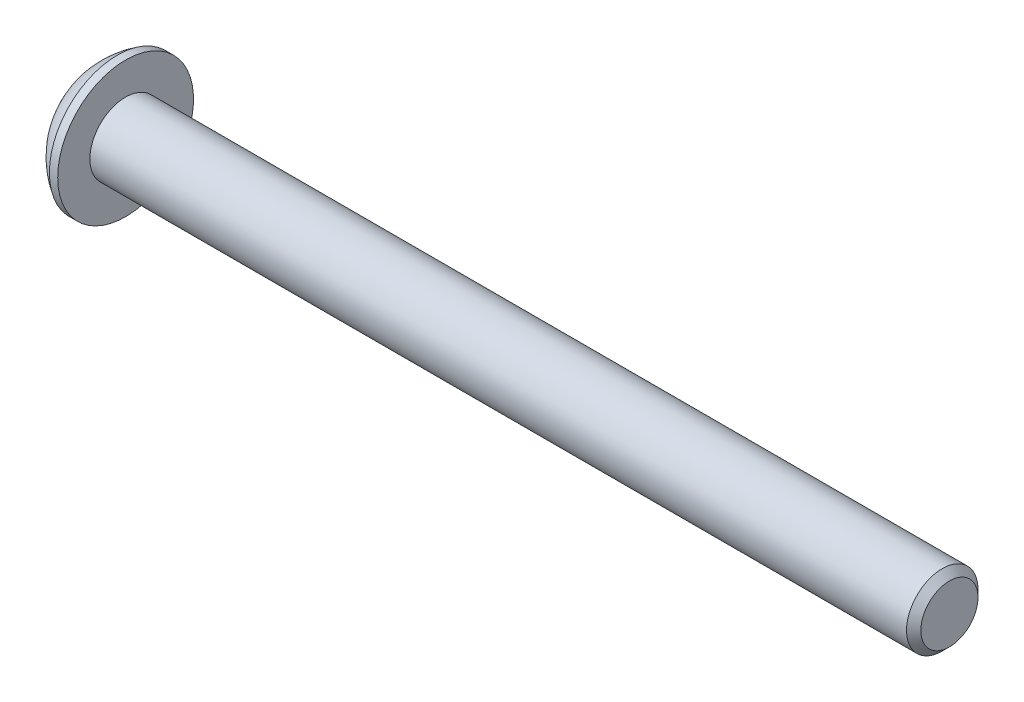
ISO-10303-21;
HEADER;
FILE_DESCRIPTION(('STEP AP214'),'2;1');
FILE_NAME('part.step','',(''),(''),'','','');
FILE_SCHEMA(('AUTOMOTIVE_DESIGN { 1 0 10303 214 1 1 1 1 }'));
ENDSEC;
DATA;
#1=APPLICATION_CONTEXT('core data for automotive mechanical design processes');
#2=APPLICATION_PROTOCOL_DEFINITION('international standard','automotive_design',2000,#1);
#3=PRODUCT_CONTEXT('',#1,'mechanical');
#4=PRODUCT('Part','Part','',(#3));
#5=PRODUCT_RELATED_PRODUCT_CATEGORY('part','',(#4));
#6=PRODUCT_DEFINITION_FORMATION('','',#4);
#7=PRODUCT_DEFINITION_CONTEXT('part definition',#1,'design');
#8=PRODUCT_DEFINITION('design','',#6,#7);
#9=PRODUCT_DEFINITION_SHAPE('','',#8);
#10=(LENGTH_UNIT() NAMED_UNIT(*) SI_UNIT(.MILLI.,.METRE.));
#11=(NAMED_UNIT(*) PLANE_ANGLE_UNIT() SI_UNIT($,.RADIAN.));
#12=(NAMED_UNIT(*) SI_UNIT($,.STERADIAN.) SOLID_ANGLE_UNIT());
#13=UNCERTAINTY_MEASURE_WITH_UNIT(LENGTH_MEASURE(1.E-05),#10,'distance_accuracy_value','');
#14=(GEOMETRIC_REPRESENTATION_CONTEXT(3) GLOBAL_UNCERTAINTY_ASSIGNED_CONTEXT((#13)) GLOBAL_UNIT_ASSIGNED_CONTEXT((#10,
#11,#12)) REPRESENTATION_CONTEXT('',''));
#15=CARTESIAN_POINT('',(0.,0.,0.));
#16=DIRECTION('',(0.,0.,1.));
#17=DIRECTION('',(1.,0.,0.));
#18=AXIS2_PLACEMENT_3D('',#15,#16,#17);
#19=CARTESIAN_POINT('',(-65.3426621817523,0.,0.));
#20=DIRECTION('',(-1.,0.,0.));
#21=DIRECTION('',(0.,0.,1.));
#22=AXIS2_PLACEMENT_3D('',#19,#20,#21);
#23=CYLINDRICAL_SURFACE('',#22,2.85);
#24=CARTESIAN_POINT('',(58.2367869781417,0.,0.));
#25=DIRECTION('',(-1.,0.,0.));
#26=DIRECTION('',(0.,0.,1.));
#27=AXIS2_PLACEMENT_3D('',#24,#25,#26);
#28=CIRCLE('',#27,2.85);
#29=CARTESIAN_POINT('',(58.2367869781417,0.,2.85));
#30=VERTEX_POINT('',#29);
#31=EDGE_CURVE('E11',#30,#30,#28,.T.);
#32=ORIENTED_EDGE('',*,*,#31,.F.);
#33=EDGE_LOOP('',(#32));
#34=FACE_BOUND('',#33,.T.);
#35=CARTESIAN_POINT('',(58.5867869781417,0.,0.));
#36=DIRECTION('',(-1.,0.,0.));
#37=DIRECTION('',(0.,0.,1.));
#38=AXIS2_PLACEMENT_3D('',#35,#36,#37);
#39=CIRCLE('',#38,2.85);
#40=CARTESIAN_POINT('',(58.5867869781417,0.,2.85));
#41=VERTEX_POINT('',#40);
#42=EDGE_CURVE('E138',#41,#41,#39,.T.);
#43=ORIENTED_EDGE('',*,*,#42,.T.);
#44=EDGE_LOOP('',(#43));
#45=FACE_BOUND('',#44,.T.);
#46=ADVANCED_FACE('F37',(#34,#45),#23,.T.);
#47=CARTESIAN_POINT('',(59.9568727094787,0.,0.));
#48=DIRECTION('',(-1.,0.,0.));
#49=DIRECTION('',(0.,0.,1.));
#50=AXIS2_PLACEMENT_3D('',#47,#48,#49);
#51=DEGENERATE_TOROIDAL_SURFACE('',#50,0.0246834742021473,3.35,.F.);
#52=CARTESIAN_POINT('',(56.9367869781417,0.,0.));
#53=DIRECTION('',(-1.,0.,0.));
#54=DIRECTION('',(0.,0.,1.));
#55=AXIS2_PLACEMENT_3D('',#52,#53,#54);
#56=CIRCLE('',#55,1.425);
#57=CARTESIAN_POINT('',(56.9367869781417,0.,1.425));
#58=VERTEX_POINT('',#57);
#59=EDGE_CURVE('E44',#58,#58,#56,.T.);
#60=ORIENTED_EDGE('',*,*,#59,.F.);
#61=EDGE_LOOP('',(#60));
#62=FACE_BOUND('',#61,.T.);
#63=ORIENTED_EDGE('',*,*,#31,.T.);
#64=EDGE_LOOP('',(#63));
#65=FACE_BOUND('',#64,.T.);
#66=ADVANCED_FACE('F159',(#62,#65),#51,.F.);
#67=CARTESIAN_POINT('',(56.9367869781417,0.,0.));
#68=DIRECTION('',(1.,0.,0.));
#69=DIRECTION('',(0.,0.,-1.));
#70=AXIS2_PLACEMENT_3D('',#67,#68,#69);
#71=PLANE('',#70);
#72=DIRECTION('',(0.,-0.5,0.866025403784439));
#73=VECTOR('',#72,1.);
#74=CARTESIAN_POINT('',(56.9367869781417,-0.577350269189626,-1.));
#75=LINE('',#74,#73);
#76=CARTESIAN_POINT('',(56.9367869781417,-0.577350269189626,-1.));
#77=VERTEX_POINT('',#76);
#78=CARTESIAN_POINT('',(56.9367869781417,-1.15470053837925,0.));
#79=VERTEX_POINT('',#78);
#80=EDGE_CURVE('E125',#77,#79,#75,.T.);
#81=ORIENTED_EDGE('',*,*,#80,.F.);
#82=DIRECTION('',(0.,-1.,0.));
#83=VECTOR('',#82,1.);
#84=CARTESIAN_POINT('',(56.9367869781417,0.577350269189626,-1.));
#85=LINE('',#84,#83);
#86=CARTESIAN_POINT('',(56.9367869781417,0.577350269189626,-1.));
#87=VERTEX_POINT('',#86);
#88=EDGE_CURVE('E51',#87,#77,#85,.T.);
#89=ORIENTED_EDGE('',*,*,#88,.F.);
#90=DIRECTION('',(0.,-0.5,-0.866025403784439));
#91=VECTOR('',#90,1.);
#92=CARTESIAN_POINT('',(56.9367869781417,1.15470053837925,0.));
#93=LINE('',#92,#91);
#94=CARTESIAN_POINT('',(56.9367869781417,1.15470053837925,0.));
#95=VERTEX_POINT('',#94);
#96=EDGE_CURVE('E134',#95,#87,#93,.T.);
#97=ORIENTED_EDGE('',*,*,#96,.F.);
#98=DIRECTION('',(0.,0.5,-0.866025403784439));
#99=VECTOR('',#98,1.);
#100=CARTESIAN_POINT('',(56.9367869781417,0.577350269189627,1.));
#101=LINE('',#100,#99);
#102=CARTESIAN_POINT('',(56.9367869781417,0.577350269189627,1.));
#103=VERTEX_POINT('',#102);
#104=EDGE_CURVE('E132',#103,#95,#101,.T.);
#105=ORIENTED_EDGE('',*,*,#104,.F.);
#106=DIRECTION('',(0.,1.,0.));
#107=VECTOR('',#106,1.);
#108=CARTESIAN_POINT('',(56.9367869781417,-0.577350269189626,1.));
#109=LINE('',#108,#107);
#110=CARTESIAN_POINT('',(56.9367869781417,-0.577350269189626,1.));
#111=VERTEX_POINT('',#110);
#112=EDGE_CURVE('E99',#111,#103,#109,.T.);
#113=ORIENTED_EDGE('',*,*,#112,.F.);
#114=DIRECTION('',(0.,0.5,0.866025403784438));
#115=VECTOR('',#114,1.);
#116=CARTESIAN_POINT('',(56.9367869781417,-1.15470053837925,0.));
#117=LINE('',#116,#115);
#118=EDGE_CURVE('E128',#79,#111,#117,.T.);
#119=ORIENTED_EDGE('',*,*,#118,.F.);
#120=EDGE_LOOP('',(#81,#89,#97,#105,#113,#119));
#121=FACE_BOUND('',#120,.T.);
#122=ORIENTED_EDGE('',*,*,#59,.T.);
#123=EDGE_LOOP('',(#122));
#124=FACE_BOUND('',#123,.T.);
#125=ADVANCED_FACE('F157',(#121,#124),#71,.F.);
#126=CARTESIAN_POINT('',(93.1667869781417,0.,0.));
#127=DIRECTION('',(-1.,0.,0.));
#128=DIRECTION('',(0.,0.,1.));
#129=AXIS2_PLACEMENT_3D('',#126,#127,#128);
#130=PLANE('',#129);
#131=CARTESIAN_POINT('',(93.1667869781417,0.,0.));
#132=DIRECTION('',(-1.,0.,0.));
#133=DIRECTION('',(0.,0.,1.));
#134=AXIS2_PLACEMENT_3D('',#131,#132,#133);
#135=CIRCLE('',#134,1.20000000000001);
#136=CARTESIAN_POINT('',(93.1667869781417,0.,1.20000000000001));
#137=VERTEX_POINT('',#136);
#138=EDGE_CURVE('E152',#137,#137,#135,.T.);
#139=ORIENTED_EDGE('',*,*,#138,.F.);
#140=EDGE_LOOP('',(#139));
#141=FACE_BOUND('',#140,.T.);
#142=ADVANCED_FACE('F184',(#141),#130,.F.);
#143=CARTESIAN_POINT('',(93.1667869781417,0.,0.));
#144=DIRECTION('',(-1.,0.,0.));
#145=DIRECTION('',(0.,0.,1.));
#146=AXIS2_PLACEMENT_3D('',#143,#144,#145);
#147=CONICAL_SURFACE('',#146,1.20000000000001,0.785398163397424);
#148=CARTESIAN_POINT('',(92.8667869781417,0.,0.));
#149=DIRECTION('',(-1.,0.,0.));
#150=DIRECTION('',(0.,0.,1.));
#151=AXIS2_PLACEMENT_3D('',#148,#149,#150);
#152=CIRCLE('',#151,1.49999999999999);
#153=CARTESIAN_POINT('',(92.8667869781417,0.,1.49999999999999));
#154=VERTEX_POINT('',#153);
#155=EDGE_CURVE('E149',#154,#154,#152,.T.);
#156=ORIENTED_EDGE('',*,*,#155,.F.);
#157=EDGE_LOOP('',(#156));
#158=FACE_BOUND('',#157,.T.);
#159=ORIENTED_EDGE('',*,*,#138,.T.);
#160=EDGE_LOOP('',(#159));
#161=FACE_BOUND('',#160,.T.);
#162=ADVANCED_FACE('F178',(#158,#161),#147,.T.);
#163=CARTESIAN_POINT('',(-65.3426621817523,0.,0.));
#164=DIRECTION('',(-1.,0.,0.));
#165=DIRECTION('',(0.,0.,1.));
#166=AXIS2_PLACEMENT_3D('',#163,#164,#165);
#167=CYLINDRICAL_SURFACE('',#166,1.49999999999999);
#168=CARTESIAN_POINT('',(58.5867869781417,0.,0.));
#169=DIRECTION('',(-1.,0.,0.));
#170=DIRECTION('',(0.,0.,1.));
#171=AXIS2_PLACEMENT_3D('',#168,#169,#170);
#172=CIRCLE('',#171,1.5);
#173=CARTESIAN_POINT('',(58.5867869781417,0.,1.5));
#174=VERTEX_POINT('',#173);
#175=EDGE_CURVE('E146',#174,#174,#172,.T.);
#176=ORIENTED_EDGE('',*,*,#175,.F.);
#177=EDGE_LOOP('',(#176));
#178=FACE_BOUND('',#177,.T.);
#179=ORIENTED_EDGE('',*,*,#155,.T.);
#180=EDGE_LOOP('',(#179));
#181=FACE_BOUND('',#180,.T.);
#182=ADVANCED_FACE('F172',(#178,#181),#167,.T.);
#183=CARTESIAN_POINT('',(58.5867869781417,0.,0.));
#184=DIRECTION('',(-1.,0.,0.));
#185=DIRECTION('',(0.,0.,1.));
#186=AXIS2_PLACEMENT_3D('',#183,#184,#185);
#187=PLANE('',#186);
#188=ORIENTED_EDGE('',*,*,#42,.F.);
#189=EDGE_LOOP('',(#188));
#190=FACE_BOUND('',#189,.T.);
#191=ORIENTED_EDGE('',*,*,#175,.T.);
#192=EDGE_LOOP('',(#191));
#193=FACE_BOUND('',#192,.T.);
#194=ADVANCED_FACE('F168',(#190,#193),#187,.F.);
#195=CARTESIAN_POINT('',(57.9367869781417,0.577350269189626,-1.));
#196=DIRECTION('',(0.,0.,-1.));
#197=DIRECTION('',(-1.,0.,0.));
#198=AXIS2_PLACEMENT_3D('',#195,#196,#197);
#199=PLANE('',#198);
#200=ORIENTED_EDGE('',*,*,#88,.T.);
#201=DIRECTION('',(-1.,0.,0.));
#202=VECTOR('',#201,1.);
#203=CARTESIAN_POINT('',(57.9367869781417,-0.577350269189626,-1.));
#204=LINE('',#203,#202);
#205=CARTESIAN_POINT('',(57.9367869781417,-0.577350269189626,-1.));
#206=VERTEX_POINT('',#205);
#207=EDGE_CURVE('E81',#206,#77,#204,.T.);
#208=ORIENTED_EDGE('',*,*,#207,.F.);
#209=DIRECTION('',(0.,-1.,0.));
#210=VECTOR('',#209,1.);
#211=CARTESIAN_POINT('',(57.9367869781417,0.577350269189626,-1.));
#212=LINE('',#211,#210);
#213=CARTESIAN_POINT('',(57.9367869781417,0.577350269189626,-1.));
#214=VERTEX_POINT('',#213);
#215=EDGE_CURVE('E136',#214,#206,#212,.T.);
#216=ORIENTED_EDGE('',*,*,#215,.F.);
#217=DIRECTION('',(-1.,0.,0.));
#218=VECTOR('',#217,1.);
#219=CARTESIAN_POINT('',(57.9367869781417,0.577350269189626,-1.));
#220=LINE('',#219,#218);
#221=EDGE_CURVE('E59',#214,#87,#220,.T.);
#222=ORIENTED_EDGE('',*,*,#221,.T.);
#223=EDGE_LOOP('',(#200,#208,#216,#222));
#224=FACE_BOUND('',#223,.T.);
#225=ADVANCED_FACE('F171',(#224),#199,.F.);
#226=CARTESIAN_POINT('',(57.9367869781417,1.15470053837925,0.));
#227=DIRECTION('',(0.,0.866025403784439,-0.5));
#228=DIRECTION('',(0.,0.5,0.866025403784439));
#229=AXIS2_PLACEMENT_3D('',#226,#227,#228);
#230=PLANE('',#229);
#231=ORIENTED_EDGE('',*,*,#96,.T.);
#232=ORIENTED_EDGE('',*,*,#221,.F.);
#233=DIRECTION('',(0.,-0.5,-0.866025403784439));
#234=VECTOR('',#233,1.);
#235=CARTESIAN_POINT('',(57.9367869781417,1.15470053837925,0.));
#236=LINE('',#235,#234);
#237=CARTESIAN_POINT('',(57.9367869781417,1.15470053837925,0.));
#238=VERTEX_POINT('',#237);
#239=EDGE_CURVE('E111',#238,#214,#236,.T.);
#240=ORIENTED_EDGE('',*,*,#239,.F.);
#241=DIRECTION('',(-1.,0.,0.));
#242=VECTOR('',#241,1.);
#243=CARTESIAN_POINT('',(57.9367869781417,1.15470053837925,0.));
#244=LINE('',#243,#242);
#245=EDGE_CURVE('E103',#238,#95,#244,.T.);
#246=ORIENTED_EDGE('',*,*,#245,.T.);
#247=EDGE_LOOP('',(#231,#232,#240,#246));
#248=FACE_BOUND('',#247,.T.);
#249=ADVANCED_FACE('F198',(#248),#230,.F.);
#250=CARTESIAN_POINT('',(57.9367869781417,0.577350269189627,1.));
#251=DIRECTION('',(0.,0.866025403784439,0.5));
#252=DIRECTION('',(0.,-0.5,0.866025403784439));
#253=AXIS2_PLACEMENT_3D('',#250,#251,#252);
#254=PLANE('',#253);
#255=ORIENTED_EDGE('',*,*,#104,.T.);
#256=ORIENTED_EDGE('',*,*,#245,.F.);
#257=DIRECTION('',(0.,0.5,-0.866025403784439));
#258=VECTOR('',#257,1.);
#259=CARTESIAN_POINT('',(57.9367869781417,0.577350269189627,1.));
#260=LINE('',#259,#258);
#261=CARTESIAN_POINT('',(57.9367869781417,0.577350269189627,1.));
#262=VERTEX_POINT('',#261);
#263=EDGE_CURVE('E107',#262,#238,#260,.T.);
#264=ORIENTED_EDGE('',*,*,#263,.F.);
#265=DIRECTION('',(-1.,0.,0.));
#266=VECTOR('',#265,1.);
#267=CARTESIAN_POINT('',(57.9367869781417,0.577350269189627,1.));
#268=LINE('',#267,#266);
#269=EDGE_CURVE('E92',#262,#103,#268,.T.);
#270=ORIENTED_EDGE('',*,*,#269,.T.);
#271=EDGE_LOOP('',(#255,#256,#264,#270));
#272=FACE_BOUND('',#271,.T.);
#273=ADVANCED_FACE('F108',(#272),#254,.F.);
#274=CARTESIAN_POINT('',(57.9367869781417,-0.577350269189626,1.));
#275=DIRECTION('',(0.,0.,1.));
#276=DIRECTION('',(1.,0.,0.));
#277=AXIS2_PLACEMENT_3D('',#274,#275,#276);
#278=PLANE('',#277);
#279=ORIENTED_EDGE('',*,*,#112,.T.);
#280=ORIENTED_EDGE('',*,*,#269,.F.);
#281=DIRECTION('',(0.,1.,0.));
#282=VECTOR('',#281,1.);
#283=CARTESIAN_POINT('',(57.9367869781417,-0.577350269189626,1.));
#284=LINE('',#283,#282);
#285=CARTESIAN_POINT('',(57.9367869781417,-0.577350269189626,1.));
#286=VERTEX_POINT('',#285);
#287=EDGE_CURVE('E96',#286,#262,#284,.T.);
#288=ORIENTED_EDGE('',*,*,#287,.F.);
#289=DIRECTION('',(-1.,0.,0.));
#290=VECTOR('',#289,1.);
#291=CARTESIAN_POINT('',(57.9367869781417,-0.577350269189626,1.));
#292=LINE('',#291,#290);
#293=EDGE_CURVE('E104',#286,#111,#292,.T.);
#294=ORIENTED_EDGE('',*,*,#293,.T.);
#295=EDGE_LOOP('',(#279,#280,#288,#294));
#296=FACE_BOUND('',#295,.T.);
#297=ADVANCED_FACE('F94',(#296),#278,.F.);
#298=CARTESIAN_POINT('',(57.9367869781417,-1.15470053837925,0.));
#299=DIRECTION('',(0.,-0.866025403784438,0.5));
#300=DIRECTION('',(0.,-0.5,-0.866025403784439));
#301=AXIS2_PLACEMENT_3D('',#298,#299,#300);
#302=PLANE('',#301);
#303=ORIENTED_EDGE('',*,*,#118,.T.);
#304=ORIENTED_EDGE('',*,*,#293,.F.);
#305=DIRECTION('',(0.,0.5,0.866025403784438));
#306=VECTOR('',#305,1.);
#307=CARTESIAN_POINT('',(57.9367869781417,-1.15470053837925,0.));
#308=LINE('',#307,#306);
#309=CARTESIAN_POINT('',(57.9367869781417,-1.15470053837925,0.));
#310=VERTEX_POINT('',#309);
#311=EDGE_CURVE('E117',#310,#286,#308,.T.);
#312=ORIENTED_EDGE('',*,*,#311,.F.);
#313=DIRECTION('',(-1.,0.,0.));
#314=VECTOR('',#313,1.);
#315=CARTESIAN_POINT('',(57.9367869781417,-1.15470053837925,0.));
#316=LINE('',#315,#314);
#317=EDGE_CURVE('E141',#310,#79,#316,.T.);
#318=ORIENTED_EDGE('',*,*,#317,.T.);
#319=EDGE_LOOP('',(#303,#304,#312,#318));
#320=FACE_BOUND('',#319,.T.);
#321=ADVANCED_FACE('F202',(#320),#302,.F.);
#322=CARTESIAN_POINT('',(57.9367869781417,-0.577350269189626,-1.));
#323=DIRECTION('',(0.,-0.866025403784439,-0.5));
#324=DIRECTION('',(0.,0.5,-0.866025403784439));
#325=AXIS2_PLACEMENT_3D('',#322,#323,#324);
#326=PLANE('',#325);
#327=ORIENTED_EDGE('',*,*,#80,.T.);
#328=ORIENTED_EDGE('',*,*,#317,.F.);
#329=DIRECTION('',(0.,-0.5,0.866025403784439));
#330=VECTOR('',#329,1.);
#331=CARTESIAN_POINT('',(57.9367869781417,-0.577350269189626,-1.));
#332=LINE('',#331,#330);
#333=EDGE_CURVE('E119',#206,#310,#332,.T.);
#334=ORIENTED_EDGE('',*,*,#333,.F.);
#335=ORIENTED_EDGE('',*,*,#207,.T.);
#336=EDGE_LOOP('',(#327,#328,#334,#335));
#337=FACE_BOUND('',#336,.T.);
#338=ADVANCED_FACE('F199',(#337),#326,.F.);
#339=CARTESIAN_POINT('',(57.9367869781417,0.,0.));
#340=DIRECTION('',(-1.,0.,0.));
#341=DIRECTION('',(0.,0.,1.));
#342=AXIS2_PLACEMENT_3D('',#339,#340,#341);
#343=PLANE('',#342);
#344=ORIENTED_EDGE('',*,*,#215,.T.);
#345=ORIENTED_EDGE('',*,*,#333,.T.);
#346=ORIENTED_EDGE('',*,*,#311,.T.);
#347=ORIENTED_EDGE('',*,*,#287,.T.);
#348=ORIENTED_EDGE('',*,*,#263,.T.);
#349=ORIENTED_EDGE('',*,*,#239,.T.);
#350=EDGE_LOOP('',(#344,#345,#346,#347,#348,#349));
#351=FACE_BOUND('',#350,.T.);
#352=ADVANCED_FACE('F114',(#351),#343,.T.);
#353=CLOSED_SHELL('',(#46,#66,#125,#142,#162,#182,#194,#225,#249,#273,#297,#321,#338,#352));
#354=MANIFOLD_SOLID_BREP('B2',#353);
#355=ADVANCED_BREP_SHAPE_REPRESENTATION('',(#18,#354),#14);
#356=SHAPE_DEFINITION_REPRESENTATION(#9,#355);
ENDSEC;
END-ISO-10303-21;
